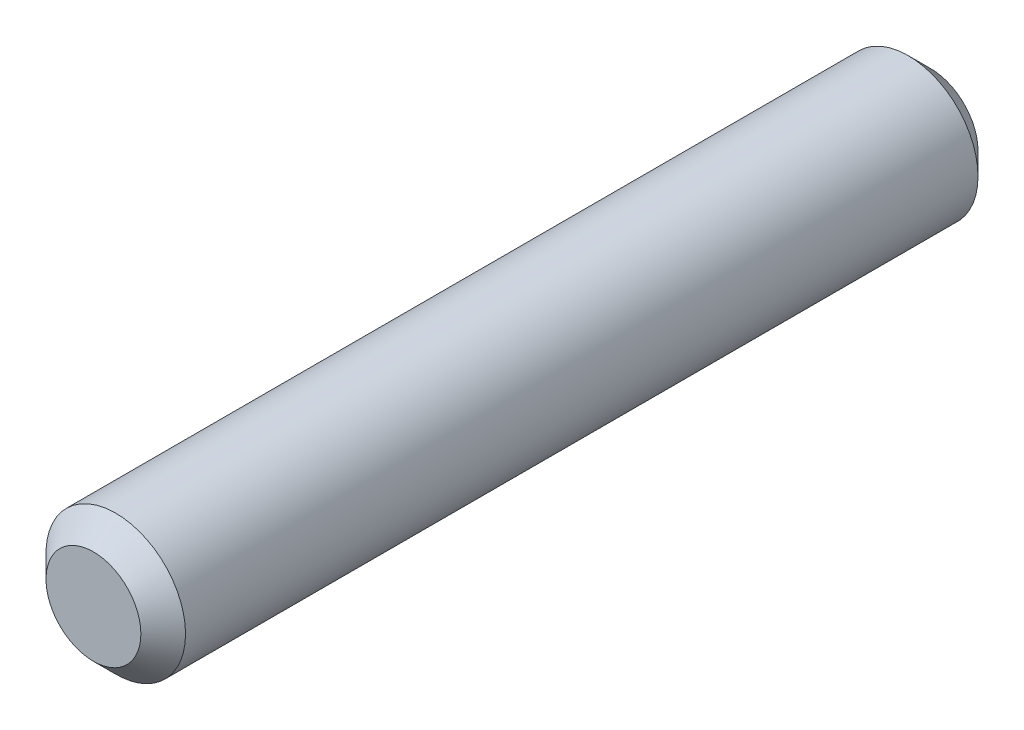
from build123d import *

# Parameters (mm, degrees)
BOSS_EXTRUDE1_DEPTH      = 4.7625
BOSS_EXTRUDE1_DEPTH_BACK = 4.7625
SKETCH1_R                = 0.79375
CHAMFER1_SIZE            = 0.254


with BuildPart() as part:
    # Sketch1 → Boss-Extrude1 (new, two sides: drawn at the far end of the back side and taken through both)
    with BuildSketch(Plane.XY.offset(-BOSS_EXTRUDE1_DEPTH_BACK)):
        Circle(SKETCH1_R)
    extrude(amount=BOSS_EXTRUDE1_DEPTH + BOSS_EXTRUDE1_DEPTH_BACK)

    # Chamfer1
    chamfer1_edges = [part.edges().sort_by_distance(p)[0] for p in [
        (-0.79375, 0, -4.7625),
        (-0.79375, 0, 4.7625),
    ]]
    chamfer(chamfer1_edges, length=CHAMFER1_SIZE)


solid = part.part
